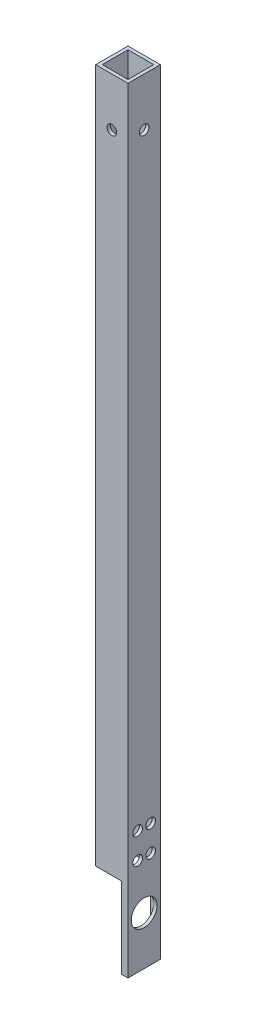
ISO-10303-21;
HEADER;
FILE_DESCRIPTION(('STEP AP214'),'2;1');
FILE_NAME('part.step','',(''),(''),'','','');
FILE_SCHEMA(('AUTOMOTIVE_DESIGN { 1 0 10303 214 1 1 1 1 }'));
ENDSEC;
DATA;
#1=APPLICATION_CONTEXT('core data for automotive mechanical design processes');
#2=APPLICATION_PROTOCOL_DEFINITION('international standard','automotive_design',2000,#1);
#3=PRODUCT_CONTEXT('',#1,'mechanical');
#4=PRODUCT('Part','Part','',(#3));
#5=PRODUCT_RELATED_PRODUCT_CATEGORY('part','',(#4));
#6=PRODUCT_DEFINITION_FORMATION('','',#4);
#7=PRODUCT_DEFINITION_CONTEXT('part definition',#1,'design');
#8=PRODUCT_DEFINITION('design','',#6,#7);
#9=PRODUCT_DEFINITION_SHAPE('','',#8);
#10=(LENGTH_UNIT() NAMED_UNIT(*) SI_UNIT(.MILLI.,.METRE.));
#11=(NAMED_UNIT(*) PLANE_ANGLE_UNIT() SI_UNIT($,.RADIAN.));
#12=(NAMED_UNIT(*) SI_UNIT($,.STERADIAN.) SOLID_ANGLE_UNIT());
#13=UNCERTAINTY_MEASURE_WITH_UNIT(LENGTH_MEASURE(1.E-05),#10,'distance_accuracy_value','');
#14=(GEOMETRIC_REPRESENTATION_CONTEXT(3) GLOBAL_UNCERTAINTY_ASSIGNED_CONTEXT((#13)) GLOBAL_UNIT_ASSIGNED_CONTEXT((#10,
#11,#12)) REPRESENTATION_CONTEXT('',''));
#15=CARTESIAN_POINT('',(0.,0.,0.));
#16=DIRECTION('',(0.,0.,1.));
#17=DIRECTION('',(1.,0.,0.));
#18=AXIS2_PLACEMENT_3D('',#15,#16,#17);
#19=CARTESIAN_POINT('',(0.,0.,0.));
#20=DIRECTION('',(0.,-1.,0.));
#21=DIRECTION('',(0.,0.,-1.));
#22=AXIS2_PLACEMENT_3D('',#19,#20,#21);
#23=PLANE('',#22);
#24=DIRECTION('',(1.,0.,0.));
#25=VECTOR('',#24,1.);
#26=CARTESIAN_POINT('',(-5.,0.,5.));
#27=LINE('',#26,#25);
#28=CARTESIAN_POINT('',(3.,0.,5.));
#29=VERTEX_POINT('',#28);
#30=CARTESIAN_POINT('',(5.,0.,5.));
#31=VERTEX_POINT('',#30);
#32=EDGE_CURVE('E155',#29,#31,#27,.T.);
#33=ORIENTED_EDGE('',*,*,#32,.F.);
#34=DIRECTION('',(0.,0.,1.));
#35=VECTOR('',#34,1.);
#36=CARTESIAN_POINT('',(3.,0.,-5.));
#37=LINE('',#36,#35);
#38=CARTESIAN_POINT('',(3.,0.,4.));
#39=VERTEX_POINT('',#38);
#40=EDGE_CURVE('E137',#39,#29,#37,.T.);
#41=ORIENTED_EDGE('',*,*,#40,.F.);
#42=DIRECTION('',(1.,0.,0.));
#43=VECTOR('',#42,1.);
#44=CARTESIAN_POINT('',(-4.,0.,4.));
#45=LINE('',#44,#43);
#46=CARTESIAN_POINT('',(4.,0.,4.));
#47=VERTEX_POINT('',#46);
#48=EDGE_CURVE('E210',#39,#47,#45,.T.);
#49=ORIENTED_EDGE('',*,*,#48,.T.);
#50=DIRECTION('',(0.,0.,-1.));
#51=VECTOR('',#50,1.);
#52=CARTESIAN_POINT('',(4.,0.,4.));
#53=LINE('',#52,#51);
#54=CARTESIAN_POINT('',(4.,0.,-4.));
#55=VERTEX_POINT('',#54);
#56=EDGE_CURVE('E277',#47,#55,#53,.T.);
#57=ORIENTED_EDGE('',*,*,#56,.T.);
#58=DIRECTION('',(-1.,0.,0.));
#59=VECTOR('',#58,1.);
#60=CARTESIAN_POINT('',(-4.,0.,-4.));
#61=LINE('',#60,#59);
#62=CARTESIAN_POINT('',(3.,0.,-4.));
#63=VERTEX_POINT('',#62);
#64=EDGE_CURVE('E148',#55,#63,#61,.T.);
#65=ORIENTED_EDGE('',*,*,#64,.T.);
#66=CARTESIAN_POINT('',(3.,0.,-5.));
#67=VERTEX_POINT('',#66);
#68=EDGE_CURVE('E129',#67,#63,#37,.T.);
#69=ORIENTED_EDGE('',*,*,#68,.F.);
#70=DIRECTION('',(-1.,0.,0.));
#71=VECTOR('',#70,1.);
#72=CARTESIAN_POINT('',(-5.,0.,-5.));
#73=LINE('',#72,#71);
#74=CARTESIAN_POINT('',(5.,0.,-5.));
#75=VERTEX_POINT('',#74);
#76=EDGE_CURVE('E144',#75,#67,#73,.T.);
#77=ORIENTED_EDGE('',*,*,#76,.F.);
#78=DIRECTION('',(0.,0.,-1.));
#79=VECTOR('',#78,1.);
#80=CARTESIAN_POINT('',(5.,0.,5.));
#81=LINE('',#80,#79);
#82=EDGE_CURVE('E156',#31,#75,#81,.T.);
#83=ORIENTED_EDGE('',*,*,#82,.F.);
#84=EDGE_LOOP('',(#33,#41,#49,#57,#65,#69,#77,#83));
#85=FACE_BOUND('',#84,.T.);
#86=ADVANCED_FACE('F33',(#85),#23,.T.);
#87=CARTESIAN_POINT('',(4.,240.,4.));
#88=DIRECTION('',(-1.,0.,0.));
#89=DIRECTION('',(0.,0.,1.));
#90=AXIS2_PLACEMENT_3D('',#87,#88,#89);
#91=PLANE('',#90);
#92=CARTESIAN_POINT('',(4.,15.,0.));
#93=DIRECTION('',(-1.,0.,0.));
#94=DIRECTION('',(0.,0.,1.));
#95=AXIS2_PLACEMENT_3D('',#92,#93,#94);
#96=CIRCLE('',#95,4.);
#97=CARTESIAN_POINT('',(4.,15.,-4.));
#98=VERTEX_POINT('',#97);
#99=CARTESIAN_POINT('',(4.,15.,4.));
#100=VERTEX_POINT('',#99);
#101=EDGE_CURVE('E54',#98,#100,#96,.F.);
#102=ORIENTED_EDGE('',*,*,#101,.T.);
#103=DIRECTION('',(0.,-1.,0.));
#104=VECTOR('',#103,1.);
#105=CARTESIAN_POINT('',(4.,240.,4.));
#106=LINE('',#105,#104);
#107=CARTESIAN_POINT('',(4.,240.,4.));
#108=VERTEX_POINT('',#107);
#109=EDGE_CURVE('E291',#108,#100,#106,.T.);
#110=ORIENTED_EDGE('',*,*,#109,.F.);
#111=DIRECTION('',(0.,0.,-1.));
#112=VECTOR('',#111,1.);
#113=CARTESIAN_POINT('',(4.,240.,4.));
#114=LINE('',#113,#112);
#115=CARTESIAN_POINT('',(4.,240.,-4.));
#116=VERTEX_POINT('',#115);
#117=EDGE_CURVE('E278',#108,#116,#114,.T.);
#118=ORIENTED_EDGE('',*,*,#117,.T.);
#119=DIRECTION('',(0.,-1.,0.));
#120=VECTOR('',#119,1.);
#121=CARTESIAN_POINT('',(4.,240.,-4.));
#122=LINE('',#121,#120);
#123=EDGE_CURVE('E160',#116,#98,#122,.T.);
#124=ORIENTED_EDGE('',*,*,#123,.T.);
#125=EDGE_LOOP('',(#102,#110,#118,#124));
#126=FACE_BOUND('',#125,.T.);
#127=CARTESIAN_POINT('',(4.,30.,2.));
#128=DIRECTION('',(-1.,0.,0.));
#129=DIRECTION('',(0.,0.,1.));
#130=AXIS2_PLACEMENT_3D('',#127,#128,#129);
#131=CIRCLE('',#130,1.5);
#132=CARTESIAN_POINT('',(4.,30.,3.5));
#133=VERTEX_POINT('',#132);
#134=EDGE_CURVE('E201',#133,#133,#131,.T.);
#135=ORIENTED_EDGE('',*,*,#134,.F.);
#136=EDGE_LOOP('',(#135));
#137=FACE_BOUND('',#136,.T.);
#138=CARTESIAN_POINT('',(4.,38.,-2.));
#139=DIRECTION('',(-1.,0.,0.));
#140=DIRECTION('',(0.,0.,1.));
#141=AXIS2_PLACEMENT_3D('',#138,#139,#140);
#142=CIRCLE('',#141,1.5);
#143=CARTESIAN_POINT('',(4.,38.,-0.499999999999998));
#144=VERTEX_POINT('',#143);
#145=EDGE_CURVE('E198',#144,#144,#142,.T.);
#146=ORIENTED_EDGE('',*,*,#145,.F.);
#147=EDGE_LOOP('',(#146));
#148=FACE_BOUND('',#147,.T.);
#149=CARTESIAN_POINT('',(4.,38.,2.));
#150=DIRECTION('',(-1.,0.,0.));
#151=DIRECTION('',(0.,0.,1.));
#152=AXIS2_PLACEMENT_3D('',#149,#150,#151);
#153=CIRCLE('',#152,1.5);
#154=CARTESIAN_POINT('',(4.,38.,3.5));
#155=VERTEX_POINT('',#154);
#156=EDGE_CURVE('E193',#155,#155,#153,.T.);
#157=ORIENTED_EDGE('',*,*,#156,.F.);
#158=EDGE_LOOP('',(#157));
#159=FACE_BOUND('',#158,.T.);
#160=CARTESIAN_POINT('',(4.,30.,-2.));
#161=DIRECTION('',(-1.,0.,0.));
#162=DIRECTION('',(0.,0.,1.));
#163=AXIS2_PLACEMENT_3D('',#160,#161,#162);
#164=CIRCLE('',#163,1.5);
#165=CARTESIAN_POINT('',(4.,30.,-0.499999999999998));
#166=VERTEX_POINT('',#165);
#167=EDGE_CURVE('E188',#166,#166,#164,.T.);
#168=ORIENTED_EDGE('',*,*,#167,.F.);
#169=EDGE_LOOP('',(#168));
#170=FACE_BOUND('',#169,.T.);
#171=CARTESIAN_POINT('',(4.,225.,0.));
#172=DIRECTION('',(-1.,0.,0.));
#173=DIRECTION('',(0.,0.,1.));
#174=AXIS2_PLACEMENT_3D('',#171,#172,#173);
#175=CIRCLE('',#174,1.5);
#176=CARTESIAN_POINT('',(4.,225.,1.5));
#177=VERTEX_POINT('',#176);
#178=EDGE_CURVE('E183',#177,#177,#175,.T.);
#179=ORIENTED_EDGE('',*,*,#178,.F.);
#180=EDGE_LOOP('',(#179));
#181=FACE_BOUND('',#180,.T.);
#182=ADVANCED_FACE('F326',(#126,#137,#148,#159,#170,#181),#91,.T.);
#183=CARTESIAN_POINT('',(0.,240.,0.));
#184=DIRECTION('',(0.,-1.,0.));
#185=DIRECTION('',(0.,0.,-1.));
#186=AXIS2_PLACEMENT_3D('',#183,#184,#185);
#187=PLANE('',#186);
#188=DIRECTION('',(0.,0.,-1.));
#189=VECTOR('',#188,1.);
#190=CARTESIAN_POINT('',(5.,240.,5.));
#191=LINE('',#190,#189);
#192=CARTESIAN_POINT('',(5.,240.,5.));
#193=VERTEX_POINT('',#192);
#194=CARTESIAN_POINT('',(5.,240.,-5.));
#195=VERTEX_POINT('',#194);
#196=EDGE_CURVE('E158',#193,#195,#191,.T.);
#197=ORIENTED_EDGE('',*,*,#196,.T.);
#198=DIRECTION('',(-1.,0.,0.));
#199=VECTOR('',#198,1.);
#200=CARTESIAN_POINT('',(-5.,240.,-5.));
#201=LINE('',#200,#199);
#202=CARTESIAN_POINT('',(-5.,240.,-5.));
#203=VERTEX_POINT('',#202);
#204=EDGE_CURVE('E304',#195,#203,#201,.T.);
#205=ORIENTED_EDGE('',*,*,#204,.T.);
#206=DIRECTION('',(0.,0.,1.));
#207=VECTOR('',#206,1.);
#208=CARTESIAN_POINT('',(-5.,240.,5.));
#209=LINE('',#208,#207);
#210=CARTESIAN_POINT('',(-5.,240.,5.));
#211=VERTEX_POINT('',#210);
#212=EDGE_CURVE('E306',#203,#211,#209,.T.);
#213=ORIENTED_EDGE('',*,*,#212,.T.);
#214=DIRECTION('',(1.,0.,0.));
#215=VECTOR('',#214,1.);
#216=CARTESIAN_POINT('',(-5.,240.,5.));
#217=LINE('',#216,#215);
#218=EDGE_CURVE('E168',#211,#193,#217,.T.);
#219=ORIENTED_EDGE('',*,*,#218,.T.);
#220=EDGE_LOOP('',(#197,#205,#213,#219));
#221=FACE_BOUND('',#220,.T.);
#222=ORIENTED_EDGE('',*,*,#117,.F.);
#223=DIRECTION('',(1.,0.,0.));
#224=VECTOR('',#223,1.);
#225=CARTESIAN_POINT('',(-4.,240.,4.));
#226=LINE('',#225,#224);
#227=CARTESIAN_POINT('',(-4.,240.,4.));
#228=VERTEX_POINT('',#227);
#229=EDGE_CURVE('E285',#228,#108,#226,.T.);
#230=ORIENTED_EDGE('',*,*,#229,.F.);
#231=DIRECTION('',(0.,0.,1.));
#232=VECTOR('',#231,1.);
#233=CARTESIAN_POINT('',(-4.,240.,4.));
#234=LINE('',#233,#232);
#235=CARTESIAN_POINT('',(-4.,240.,-4.));
#236=VERTEX_POINT('',#235);
#237=EDGE_CURVE('E282',#236,#228,#234,.T.);
#238=ORIENTED_EDGE('',*,*,#237,.F.);
#239=DIRECTION('',(-1.,0.,0.));
#240=VECTOR('',#239,1.);
#241=CARTESIAN_POINT('',(-4.,240.,-4.));
#242=LINE('',#241,#240);
#243=EDGE_CURVE('E280',#116,#236,#242,.T.);
#244=ORIENTED_EDGE('',*,*,#243,.F.);
#245=EDGE_LOOP('',(#222,#230,#238,#244));
#246=FACE_BOUND('',#245,.T.);
#247=ADVANCED_FACE('F310',(#221,#246),#187,.F.);
#248=CARTESIAN_POINT('',(5.,240.,5.));
#249=DIRECTION('',(-1.,0.,0.));
#250=DIRECTION('',(0.,0.,1.));
#251=AXIS2_PLACEMENT_3D('',#248,#249,#250);
#252=PLANE('',#251);
#253=CARTESIAN_POINT('',(5.,15.,0.));
#254=DIRECTION('',(1.,0.,0.));
#255=DIRECTION('',(0.,0.,-1.));
#256=AXIS2_PLACEMENT_3D('',#253,#254,#255);
#257=CIRCLE('',#256,4.);
#258=CARTESIAN_POINT('',(5.,15.,-4.));
#259=VERTEX_POINT('',#258);
#260=EDGE_CURVE('E228',#259,#259,#257,.T.);
#261=ORIENTED_EDGE('',*,*,#260,.F.);
#262=EDGE_LOOP('',(#261));
#263=FACE_BOUND('',#262,.T.);
#264=CARTESIAN_POINT('',(5.,30.,2.));
#265=DIRECTION('',(1.,0.,0.));
#266=DIRECTION('',(0.,0.,-1.));
#267=AXIS2_PLACEMENT_3D('',#264,#265,#266);
#268=CIRCLE('',#267,1.5);
#269=CARTESIAN_POINT('',(5.,30.,0.499999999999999));
#270=VERTEX_POINT('',#269);
#271=EDGE_CURVE('E234',#270,#270,#268,.T.);
#272=ORIENTED_EDGE('',*,*,#271,.F.);
#273=EDGE_LOOP('',(#272));
#274=FACE_BOUND('',#273,.T.);
#275=CARTESIAN_POINT('',(5.,38.,-2.));
#276=DIRECTION('',(1.,0.,0.));
#277=DIRECTION('',(0.,0.,-1.));
#278=AXIS2_PLACEMENT_3D('',#275,#276,#277);
#279=CIRCLE('',#278,1.5);
#280=CARTESIAN_POINT('',(5.,38.,-3.5));
#281=VERTEX_POINT('',#280);
#282=EDGE_CURVE('E240',#281,#281,#279,.T.);
#283=ORIENTED_EDGE('',*,*,#282,.F.);
#284=EDGE_LOOP('',(#283));
#285=FACE_BOUND('',#284,.T.);
#286=CARTESIAN_POINT('',(5.,38.,2.));
#287=DIRECTION('',(1.,0.,0.));
#288=DIRECTION('',(0.,0.,-1.));
#289=AXIS2_PLACEMENT_3D('',#286,#287,#288);
#290=CIRCLE('',#289,1.5);
#291=CARTESIAN_POINT('',(5.,38.,0.499999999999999));
#292=VERTEX_POINT('',#291);
#293=EDGE_CURVE('E233',#292,#292,#290,.T.);
#294=ORIENTED_EDGE('',*,*,#293,.F.);
#295=EDGE_LOOP('',(#294));
#296=FACE_BOUND('',#295,.T.);
#297=CARTESIAN_POINT('',(5.,30.,-2.));
#298=DIRECTION('',(1.,0.,0.));
#299=DIRECTION('',(0.,0.,-1.));
#300=AXIS2_PLACEMENT_3D('',#297,#298,#299);
#301=CIRCLE('',#300,1.5);
#302=CARTESIAN_POINT('',(5.,30.,-3.5));
#303=VERTEX_POINT('',#302);
#304=EDGE_CURVE('E256',#303,#303,#301,.T.);
#305=ORIENTED_EDGE('',*,*,#304,.F.);
#306=EDGE_LOOP('',(#305));
#307=FACE_BOUND('',#306,.T.);
#308=CARTESIAN_POINT('',(5.,225.,0.));
#309=DIRECTION('',(1.,0.,0.));
#310=DIRECTION('',(0.,0.,-1.));
#311=AXIS2_PLACEMENT_3D('',#308,#309,#310);
#312=CIRCLE('',#311,1.5);
#313=CARTESIAN_POINT('',(5.,225.,-1.5));
#314=VERTEX_POINT('',#313);
#315=EDGE_CURVE('E263',#314,#314,#312,.T.);
#316=ORIENTED_EDGE('',*,*,#315,.F.);
#317=EDGE_LOOP('',(#316));
#318=FACE_BOUND('',#317,.T.);
#319=ORIENTED_EDGE('',*,*,#82,.T.);
#320=DIRECTION('',(0.,-1.,0.));
#321=VECTOR('',#320,1.);
#322=CARTESIAN_POINT('',(5.,240.,-5.));
#323=LINE('',#322,#321);
#324=EDGE_CURVE('E153',#195,#75,#323,.T.);
#325=ORIENTED_EDGE('',*,*,#324,.F.);
#326=ORIENTED_EDGE('',*,*,#196,.F.);
#327=DIRECTION('',(0.,-1.,0.));
#328=VECTOR('',#327,1.);
#329=CARTESIAN_POINT('',(5.,240.,5.));
#330=LINE('',#329,#328);
#331=EDGE_CURVE('E164',#193,#31,#330,.T.);
#332=ORIENTED_EDGE('',*,*,#331,.T.);
#333=EDGE_LOOP('',(#319,#325,#326,#332));
#334=FACE_BOUND('',#333,.T.);
#335=ADVANCED_FACE('F35',(#263,#274,#285,#296,#307,#318,#334),#252,.F.);
#336=CARTESIAN_POINT('',(-5.,240.,-5.));
#337=DIRECTION('',(0.,0.,1.));
#338=DIRECTION('',(1.,0.,0.));
#339=AXIS2_PLACEMENT_3D('',#336,#337,#338);
#340=PLANE('',#339);
#341=CARTESIAN_POINT('',(0.,225.,-5.));
#342=DIRECTION('',(0.,0.,1.));
#343=DIRECTION('',(1.,0.,0.));
#344=AXIS2_PLACEMENT_3D('',#341,#342,#343);
#345=CIRCLE('',#344,1.5);
#346=CARTESIAN_POINT('',(1.5,225.,-5.));
#347=VERTEX_POINT('',#346);
#348=EDGE_CURVE('E179',#347,#347,#345,.F.);
#349=ORIENTED_EDGE('',*,*,#348,.F.);
#350=EDGE_LOOP('',(#349));
#351=FACE_BOUND('',#350,.T.);
#352=DIRECTION('',(0.,-1.,0.));
#353=VECTOR('',#352,1.);
#354=CARTESIAN_POINT('',(3.,25.,-5.));
#355=LINE('',#354,#353);
#356=CARTESIAN_POINT('',(3.,25.,-5.));
#357=VERTEX_POINT('',#356);
#358=EDGE_CURVE('E126',#357,#67,#355,.T.);
#359=ORIENTED_EDGE('',*,*,#358,.F.);
#360=DIRECTION('',(-1.,0.,0.));
#361=VECTOR('',#360,1.);
#362=CARTESIAN_POINT('',(3.,25.,-5.));
#363=LINE('',#362,#361);
#364=CARTESIAN_POINT('',(-5.,25.,-5.));
#365=VERTEX_POINT('',#364);
#366=EDGE_CURVE('E219',#357,#365,#363,.T.);
#367=ORIENTED_EDGE('',*,*,#366,.T.);
#368=DIRECTION('',(0.,-1.,0.));
#369=VECTOR('',#368,1.);
#370=CARTESIAN_POINT('',(-5.,240.,-5.));
#371=LINE('',#370,#369);
#372=EDGE_CURVE('E171',#203,#365,#371,.T.);
#373=ORIENTED_EDGE('',*,*,#372,.F.);
#374=ORIENTED_EDGE('',*,*,#204,.F.);
#375=ORIENTED_EDGE('',*,*,#324,.T.);
#376=ORIENTED_EDGE('',*,*,#76,.T.);
#377=EDGE_LOOP('',(#359,#367,#373,#374,#375,#376));
#378=FACE_BOUND('',#377,.T.);
#379=ADVANCED_FACE('F151',(#351,#378),#340,.F.);
#380=CARTESIAN_POINT('',(-5.,240.,5.));
#381=DIRECTION('',(1.,0.,0.));
#382=DIRECTION('',(0.,0.,-1.));
#383=AXIS2_PLACEMENT_3D('',#380,#381,#382);
#384=PLANE('',#383);
#385=CARTESIAN_POINT('',(-5.,30.,2.));
#386=DIRECTION('',(1.,0.,0.));
#387=DIRECTION('',(0.,0.,-1.));
#388=AXIS2_PLACEMENT_3D('',#385,#386,#387);
#389=CIRCLE('',#388,1.5);
#390=CARTESIAN_POINT('',(-5.,30.,0.5));
#391=VERTEX_POINT('',#390);
#392=EDGE_CURVE('E194',#391,#391,#389,.F.);
#393=ORIENTED_EDGE('',*,*,#392,.F.);
#394=EDGE_LOOP('',(#393));
#395=FACE_BOUND('',#394,.T.);
#396=CARTESIAN_POINT('',(-5.,38.,-2.));
#397=DIRECTION('',(1.,0.,0.));
#398=DIRECTION('',(0.,0.,-1.));
#399=AXIS2_PLACEMENT_3D('',#396,#397,#398);
#400=CIRCLE('',#399,1.5);
#401=CARTESIAN_POINT('',(-5.,38.,-3.5));
#402=VERTEX_POINT('',#401);
#403=EDGE_CURVE('E237',#402,#402,#400,.F.);
#404=ORIENTED_EDGE('',*,*,#403,.F.);
#405=EDGE_LOOP('',(#404));
#406=FACE_BOUND('',#405,.T.);
#407=CARTESIAN_POINT('',(-5.,38.,2.));
#408=DIRECTION('',(1.,0.,0.));
#409=DIRECTION('',(0.,0.,-1.));
#410=AXIS2_PLACEMENT_3D('',#407,#408,#409);
#411=CIRCLE('',#410,1.5);
#412=CARTESIAN_POINT('',(-5.,38.,0.5));
#413=VERTEX_POINT('',#412);
#414=EDGE_CURVE('E243',#413,#413,#411,.F.);
#415=ORIENTED_EDGE('',*,*,#414,.F.);
#416=EDGE_LOOP('',(#415));
#417=FACE_BOUND('',#416,.T.);
#418=CARTESIAN_POINT('',(-5.,30.,-2.));
#419=DIRECTION('',(1.,0.,0.));
#420=DIRECTION('',(0.,0.,-1.));
#421=AXIS2_PLACEMENT_3D('',#418,#419,#420);
#422=CIRCLE('',#421,1.5);
#423=CARTESIAN_POINT('',(-5.,30.,-3.5));
#424=VERTEX_POINT('',#423);
#425=EDGE_CURVE('E189',#424,#424,#422,.F.);
#426=ORIENTED_EDGE('',*,*,#425,.F.);
#427=EDGE_LOOP('',(#426));
#428=FACE_BOUND('',#427,.T.);
#429=CARTESIAN_POINT('',(-5.,225.,0.));
#430=DIRECTION('',(1.,0.,0.));
#431=DIRECTION('',(0.,0.,-1.));
#432=AXIS2_PLACEMENT_3D('',#429,#430,#431);
#433=CIRCLE('',#432,1.5);
#434=CARTESIAN_POINT('',(-5.,225.,-1.5));
#435=VERTEX_POINT('',#434);
#436=EDGE_CURVE('E184',#435,#435,#433,.F.);
#437=ORIENTED_EDGE('',*,*,#436,.F.);
#438=EDGE_LOOP('',(#437));
#439=FACE_BOUND('',#438,.T.);
#440=ORIENTED_EDGE('',*,*,#372,.T.);
#441=DIRECTION('',(0.,0.,-1.));
#442=VECTOR('',#441,1.);
#443=CARTESIAN_POINT('',(-5.,25.,-5.));
#444=LINE('',#443,#442);
#445=CARTESIAN_POINT('',(-5.,25.,5.));
#446=VERTEX_POINT('',#445);
#447=EDGE_CURVE('E138',#446,#365,#444,.T.);
#448=ORIENTED_EDGE('',*,*,#447,.F.);
#449=DIRECTION('',(0.,-1.,0.));
#450=VECTOR('',#449,1.);
#451=CARTESIAN_POINT('',(-5.,240.,5.));
#452=LINE('',#451,#450);
#453=EDGE_CURVE('E167',#211,#446,#452,.T.);
#454=ORIENTED_EDGE('',*,*,#453,.F.);
#455=ORIENTED_EDGE('',*,*,#212,.F.);
#456=EDGE_LOOP('',(#440,#448,#454,#455));
#457=FACE_BOUND('',#456,.T.);
#458=ADVANCED_FACE('F324',(#395,#406,#417,#428,#439,#457),#384,.F.);
#459=CARTESIAN_POINT('',(-5.,240.,5.));
#460=DIRECTION('',(0.,0.,-1.));
#461=DIRECTION('',(-1.,0.,0.));
#462=AXIS2_PLACEMENT_3D('',#459,#460,#461);
#463=PLANE('',#462);
#464=CARTESIAN_POINT('',(0.,225.,5.));
#465=DIRECTION('',(0.,0.,1.));
#466=DIRECTION('',(1.,0.,0.));
#467=AXIS2_PLACEMENT_3D('',#464,#465,#466);
#468=CIRCLE('',#467,1.5);
#469=CARTESIAN_POINT('',(1.5,225.,5.));
#470=VERTEX_POINT('',#469);
#471=EDGE_CURVE('E270',#470,#470,#468,.T.);
#472=ORIENTED_EDGE('',*,*,#471,.F.);
#473=EDGE_LOOP('',(#472));
#474=FACE_BOUND('',#473,.T.);
#475=ORIENTED_EDGE('',*,*,#453,.T.);
#476=DIRECTION('',(-1.,0.,0.));
#477=VECTOR('',#476,1.);
#478=CARTESIAN_POINT('',(3.,25.,5.));
#479=LINE('',#478,#477);
#480=CARTESIAN_POINT('',(3.,25.,5.));
#481=VERTEX_POINT('',#480);
#482=EDGE_CURVE('E217',#481,#446,#479,.T.);
#483=ORIENTED_EDGE('',*,*,#482,.F.);
#484=DIRECTION('',(0.,1.,0.));
#485=VECTOR('',#484,1.);
#486=CARTESIAN_POINT('',(3.,25.,5.));
#487=LINE('',#486,#485);
#488=EDGE_CURVE('E149',#29,#481,#487,.T.);
#489=ORIENTED_EDGE('',*,*,#488,.F.);
#490=ORIENTED_EDGE('',*,*,#32,.T.);
#491=ORIENTED_EDGE('',*,*,#331,.F.);
#492=ORIENTED_EDGE('',*,*,#218,.F.);
#493=EDGE_LOOP('',(#475,#483,#489,#490,#491,#492));
#494=FACE_BOUND('',#493,.T.);
#495=ADVANCED_FACE('F316',(#474,#494),#463,.F.);
#496=EDGE_CURVE('E231',#100,#98,#96,.F.);
#497=ORIENTED_EDGE('',*,*,#496,.T.);
#498=EDGE_CURVE('E299',#98,#55,#122,.T.);
#499=ORIENTED_EDGE('',*,*,#498,.T.);
#500=ORIENTED_EDGE('',*,*,#56,.F.);
#501=EDGE_CURVE('E287',#100,#47,#106,.T.);
#502=ORIENTED_EDGE('',*,*,#501,.F.);
#503=EDGE_LOOP('',(#497,#499,#500,#502));
#504=FACE_BOUND('',#503,.T.);
#505=ADVANCED_FACE('F337',(#504),#91,.T.);
#506=CARTESIAN_POINT('',(-4.,240.,-4.));
#507=DIRECTION('',(0.,0.,1.));
#508=DIRECTION('',(1.,0.,0.));
#509=AXIS2_PLACEMENT_3D('',#506,#507,#508);
#510=PLANE('',#509);
#511=DIRECTION('',(-1.,0.,0.));
#512=VECTOR('',#511,1.);
#513=CARTESIAN_POINT('',(-4.,25.,-4.));
#514=LINE('',#513,#512);
#515=CARTESIAN_POINT('',(3.,25.,-4.));
#516=VERTEX_POINT('',#515);
#517=CARTESIAN_POINT('',(-4.,25.,-4.));
#518=VERTEX_POINT('',#517);
#519=EDGE_CURVE('E226',#516,#518,#514,.T.);
#520=ORIENTED_EDGE('',*,*,#519,.F.);
#521=DIRECTION('',(0.,-1.,0.));
#522=VECTOR('',#521,1.);
#523=CARTESIAN_POINT('',(3.,240.,-4.));
#524=LINE('',#523,#522);
#525=EDGE_CURVE('E221',#516,#63,#524,.T.);
#526=ORIENTED_EDGE('',*,*,#525,.T.);
#527=ORIENTED_EDGE('',*,*,#64,.F.);
#528=ORIENTED_EDGE('',*,*,#498,.F.);
#529=ORIENTED_EDGE('',*,*,#123,.F.);
#530=ORIENTED_EDGE('',*,*,#243,.T.);
#531=DIRECTION('',(0.,-1.,0.));
#532=VECTOR('',#531,1.);
#533=CARTESIAN_POINT('',(-4.,240.,-4.));
#534=LINE('',#533,#532);
#535=EDGE_CURVE('E296',#236,#518,#534,.T.);
#536=ORIENTED_EDGE('',*,*,#535,.T.);
#537=EDGE_LOOP('',(#520,#526,#527,#528,#529,#530,#536));
#538=FACE_BOUND('',#537,.T.);
#539=CARTESIAN_POINT('',(0.,225.,-4.));
#540=DIRECTION('',(0.,0.,1.));
#541=DIRECTION('',(1.,0.,0.));
#542=AXIS2_PLACEMENT_3D('',#539,#540,#541);
#543=CIRCLE('',#542,1.5);
#544=CARTESIAN_POINT('',(1.5,225.,-4.));
#545=VERTEX_POINT('',#544);
#546=EDGE_CURVE('E178',#545,#545,#543,.T.);
#547=ORIENTED_EDGE('',*,*,#546,.F.);
#548=EDGE_LOOP('',(#547));
#549=FACE_BOUND('',#548,.T.);
#550=ADVANCED_FACE('F369',(#538,#549),#510,.T.);
#551=CARTESIAN_POINT('',(-4.,240.,4.));
#552=DIRECTION('',(1.,0.,0.));
#553=DIRECTION('',(0.,0.,-1.));
#554=AXIS2_PLACEMENT_3D('',#551,#552,#553);
#555=PLANE('',#554);
#556=DIRECTION('',(0.,0.,1.));
#557=VECTOR('',#556,1.);
#558=CARTESIAN_POINT('',(-4.,25.,3.99999999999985));
#559=LINE('',#558,#557);
#560=CARTESIAN_POINT('',(-4.,25.,4.));
#561=VERTEX_POINT('',#560);
#562=EDGE_CURVE('E224',#518,#561,#559,.T.);
#563=ORIENTED_EDGE('',*,*,#562,.F.);
#564=ORIENTED_EDGE('',*,*,#535,.F.);
#565=ORIENTED_EDGE('',*,*,#237,.T.);
#566=DIRECTION('',(0.,-1.,0.));
#567=VECTOR('',#566,1.);
#568=CARTESIAN_POINT('',(-4.,240.,4.));
#569=LINE('',#568,#567);
#570=EDGE_CURVE('E294',#228,#561,#569,.T.);
#571=ORIENTED_EDGE('',*,*,#570,.T.);
#572=EDGE_LOOP('',(#563,#564,#565,#571));
#573=FACE_BOUND('',#572,.T.);
#574=CARTESIAN_POINT('',(-4.,30.,2.));
#575=DIRECTION('',(1.,0.,0.));
#576=DIRECTION('',(0.,0.,-1.));
#577=AXIS2_PLACEMENT_3D('',#574,#575,#576);
#578=CIRCLE('',#577,1.5);
#579=CARTESIAN_POINT('',(-4.,30.,0.5));
#580=VERTEX_POINT('',#579);
#581=EDGE_CURVE('E199',#580,#580,#578,.T.);
#582=ORIENTED_EDGE('',*,*,#581,.F.);
#583=EDGE_LOOP('',(#582));
#584=FACE_BOUND('',#583,.T.);
#585=CARTESIAN_POINT('',(-4.,38.,-2.));
#586=DIRECTION('',(1.,0.,0.));
#587=DIRECTION('',(0.,0.,-1.));
#588=AXIS2_PLACEMENT_3D('',#585,#586,#587);
#589=CIRCLE('',#588,1.5);
#590=CARTESIAN_POINT('',(-4.,38.,-3.5));
#591=VERTEX_POINT('',#590);
#592=EDGE_CURVE('E195',#591,#591,#589,.T.);
#593=ORIENTED_EDGE('',*,*,#592,.F.);
#594=EDGE_LOOP('',(#593));
#595=FACE_BOUND('',#594,.T.);
#596=CARTESIAN_POINT('',(-4.,38.,2.));
#597=DIRECTION('',(1.,0.,0.));
#598=DIRECTION('',(0.,0.,-1.));
#599=AXIS2_PLACEMENT_3D('',#596,#597,#598);
#600=CIRCLE('',#599,1.5);
#601=CARTESIAN_POINT('',(-4.,38.,0.5));
#602=VERTEX_POINT('',#601);
#603=EDGE_CURVE('E190',#602,#602,#600,.T.);
#604=ORIENTED_EDGE('',*,*,#603,.F.);
#605=EDGE_LOOP('',(#604));
#606=FACE_BOUND('',#605,.T.);
#607=CARTESIAN_POINT('',(-4.,30.,-2.));
#608=DIRECTION('',(1.,0.,0.));
#609=DIRECTION('',(0.,0.,-1.));
#610=AXIS2_PLACEMENT_3D('',#607,#608,#609);
#611=CIRCLE('',#610,1.5);
#612=CARTESIAN_POINT('',(-4.,30.,-3.5));
#613=VERTEX_POINT('',#612);
#614=EDGE_CURVE('E185',#613,#613,#611,.T.);
#615=ORIENTED_EDGE('',*,*,#614,.F.);
#616=EDGE_LOOP('',(#615));
#617=FACE_BOUND('',#616,.T.);
#618=CARTESIAN_POINT('',(-4.,225.,0.));
#619=DIRECTION('',(1.,0.,0.));
#620=DIRECTION('',(0.,0.,-1.));
#621=AXIS2_PLACEMENT_3D('',#618,#619,#620);
#622=CIRCLE('',#621,1.5);
#623=CARTESIAN_POINT('',(-4.,225.,-1.5));
#624=VERTEX_POINT('',#623);
#625=EDGE_CURVE('E180',#624,#624,#622,.T.);
#626=ORIENTED_EDGE('',*,*,#625,.F.);
#627=EDGE_LOOP('',(#626));
#628=FACE_BOUND('',#627,.T.);
#629=ADVANCED_FACE('F365',(#573,#584,#595,#606,#617,#628),#555,.T.);
#630=CARTESIAN_POINT('',(-4.,240.,4.));
#631=DIRECTION('',(0.,0.,-1.));
#632=DIRECTION('',(-1.,0.,0.));
#633=AXIS2_PLACEMENT_3D('',#630,#631,#632);
#634=PLANE('',#633);
#635=DIRECTION('',(1.,0.,0.));
#636=VECTOR('',#635,1.);
#637=CARTESIAN_POINT('',(-4.,25.,4.));
#638=LINE('',#637,#636);
#639=CARTESIAN_POINT('',(3.,25.,4.));
#640=VERTEX_POINT('',#639);
#641=EDGE_CURVE('E11',#561,#640,#638,.T.);
#642=ORIENTED_EDGE('',*,*,#641,.F.);
#643=ORIENTED_EDGE('',*,*,#570,.F.);
#644=ORIENTED_EDGE('',*,*,#229,.T.);
#645=ORIENTED_EDGE('',*,*,#109,.T.);
#646=ORIENTED_EDGE('',*,*,#501,.T.);
#647=ORIENTED_EDGE('',*,*,#48,.F.);
#648=DIRECTION('',(0.,1.,0.));
#649=VECTOR('',#648,1.);
#650=CARTESIAN_POINT('',(3.,240.,4.));
#651=LINE('',#650,#649);
#652=EDGE_CURVE('E41',#39,#640,#651,.T.);
#653=ORIENTED_EDGE('',*,*,#652,.T.);
#654=EDGE_LOOP('',(#642,#643,#644,#645,#646,#647,#653));
#655=FACE_BOUND('',#654,.T.);
#656=CARTESIAN_POINT('',(0.,225.,4.));
#657=DIRECTION('',(0.,0.,-1.));
#658=DIRECTION('',(-1.,0.,0.));
#659=AXIS2_PLACEMENT_3D('',#656,#657,#658);
#660=CIRCLE('',#659,1.5);
#661=CARTESIAN_POINT('',(-1.5,225.,4.));
#662=VERTEX_POINT('',#661);
#663=EDGE_CURVE('E175',#662,#662,#660,.T.);
#664=ORIENTED_EDGE('',*,*,#663,.F.);
#665=EDGE_LOOP('',(#664));
#666=FACE_BOUND('',#665,.T.);
#667=ADVANCED_FACE('F206',(#655,#666),#634,.T.);
#668=CARTESIAN_POINT('',(0.,225.,-9.24264068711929));
#669=DIRECTION('',(0.,0.,1.));
#670=DIRECTION('',(1.,0.,0.));
#671=AXIS2_PLACEMENT_3D('',#668,#669,#670);
#672=CYLINDRICAL_SURFACE('',#671,1.5);
#673=ORIENTED_EDGE('',*,*,#663,.T.);
#674=EDGE_LOOP('',(#673));
#675=FACE_BOUND('',#674,.T.);
#676=ORIENTED_EDGE('',*,*,#471,.T.);
#677=EDGE_LOOP('',(#676));
#678=FACE_BOUND('',#677,.T.);
#679=ADVANCED_FACE('F419',(#675,#678),#672,.F.);
#680=ORIENTED_EDGE('',*,*,#546,.T.);
#681=EDGE_LOOP('',(#680));
#682=FACE_BOUND('',#681,.T.);
#683=ORIENTED_EDGE('',*,*,#348,.T.);
#684=EDGE_LOOP('',(#683));
#685=FACE_BOUND('',#684,.T.);
#686=ADVANCED_FACE('F417',(#682,#685),#672,.F.);
#687=CARTESIAN_POINT('',(-9.24264068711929,225.,0.));
#688=DIRECTION('',(1.,0.,0.));
#689=DIRECTION('',(0.,0.,-1.));
#690=AXIS2_PLACEMENT_3D('',#687,#688,#689);
#691=CYLINDRICAL_SURFACE('',#690,1.5);
#692=ORIENTED_EDGE('',*,*,#625,.T.);
#693=EDGE_LOOP('',(#692));
#694=FACE_BOUND('',#693,.T.);
#695=ORIENTED_EDGE('',*,*,#436,.T.);
#696=EDGE_LOOP('',(#695));
#697=FACE_BOUND('',#696,.T.);
#698=ADVANCED_FACE('F414',(#694,#697),#691,.F.);
#699=ORIENTED_EDGE('',*,*,#178,.T.);
#700=EDGE_LOOP('',(#699));
#701=FACE_BOUND('',#700,.T.);
#702=ORIENTED_EDGE('',*,*,#315,.T.);
#703=EDGE_LOOP('',(#702));
#704=FACE_BOUND('',#703,.T.);
#705=ADVANCED_FACE('F412',(#701,#704),#691,.F.);
#706=CARTESIAN_POINT('',(-9.24264068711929,30.,-2.));
#707=DIRECTION('',(1.,0.,0.));
#708=DIRECTION('',(0.,0.,-1.));
#709=AXIS2_PLACEMENT_3D('',#706,#707,#708);
#710=CYLINDRICAL_SURFACE('',#709,1.5);
#711=ORIENTED_EDGE('',*,*,#614,.T.);
#712=EDGE_LOOP('',(#711));
#713=FACE_BOUND('',#712,.T.);
#714=ORIENTED_EDGE('',*,*,#425,.T.);
#715=EDGE_LOOP('',(#714));
#716=FACE_BOUND('',#715,.T.);
#717=ADVANCED_FACE('F409',(#713,#716),#710,.F.);
#718=ORIENTED_EDGE('',*,*,#167,.T.);
#719=EDGE_LOOP('',(#718));
#720=FACE_BOUND('',#719,.T.);
#721=ORIENTED_EDGE('',*,*,#304,.T.);
#722=EDGE_LOOP('',(#721));
#723=FACE_BOUND('',#722,.T.);
#724=ADVANCED_FACE('F407',(#720,#723),#710,.F.);
#725=CARTESIAN_POINT('',(-9.24264068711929,38.,2.));
#726=DIRECTION('',(1.,0.,0.));
#727=DIRECTION('',(0.,0.,-1.));
#728=AXIS2_PLACEMENT_3D('',#725,#726,#727);
#729=CYLINDRICAL_SURFACE('',#728,1.5);
#730=ORIENTED_EDGE('',*,*,#603,.T.);
#731=EDGE_LOOP('',(#730));
#732=FACE_BOUND('',#731,.T.);
#733=ORIENTED_EDGE('',*,*,#414,.T.);
#734=EDGE_LOOP('',(#733));
#735=FACE_BOUND('',#734,.T.);
#736=ADVANCED_FACE('F403',(#732,#735),#729,.F.);
#737=CARTESIAN_POINT('',(-9.24264068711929,38.,-2.));
#738=DIRECTION('',(1.,0.,0.));
#739=DIRECTION('',(0.,0.,-1.));
#740=AXIS2_PLACEMENT_3D('',#737,#738,#739);
#741=CYLINDRICAL_SURFACE('',#740,1.5);
#742=ORIENTED_EDGE('',*,*,#592,.T.);
#743=EDGE_LOOP('',(#742));
#744=FACE_BOUND('',#743,.T.);
#745=ORIENTED_EDGE('',*,*,#403,.T.);
#746=EDGE_LOOP('',(#745));
#747=FACE_BOUND('',#746,.T.);
#748=ADVANCED_FACE('F399',(#744,#747),#741,.F.);
#749=CARTESIAN_POINT('',(-9.24264068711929,30.,2.));
#750=DIRECTION('',(1.,0.,0.));
#751=DIRECTION('',(0.,0.,-1.));
#752=AXIS2_PLACEMENT_3D('',#749,#750,#751);
#753=CYLINDRICAL_SURFACE('',#752,1.5);
#754=ORIENTED_EDGE('',*,*,#581,.T.);
#755=EDGE_LOOP('',(#754));
#756=FACE_BOUND('',#755,.T.);
#757=ORIENTED_EDGE('',*,*,#392,.T.);
#758=EDGE_LOOP('',(#757));
#759=FACE_BOUND('',#758,.T.);
#760=ADVANCED_FACE('F394',(#756,#759),#753,.F.);
#761=ORIENTED_EDGE('',*,*,#156,.T.);
#762=EDGE_LOOP('',(#761));
#763=FACE_BOUND('',#762,.T.);
#764=ORIENTED_EDGE('',*,*,#293,.T.);
#765=EDGE_LOOP('',(#764));
#766=FACE_BOUND('',#765,.T.);
#767=ADVANCED_FACE('F398',(#763,#766),#729,.F.);
#768=ORIENTED_EDGE('',*,*,#145,.T.);
#769=EDGE_LOOP('',(#768));
#770=FACE_BOUND('',#769,.T.);
#771=ORIENTED_EDGE('',*,*,#282,.T.);
#772=EDGE_LOOP('',(#771));
#773=FACE_BOUND('',#772,.T.);
#774=ADVANCED_FACE('F391',(#770,#773),#741,.F.);
#775=ORIENTED_EDGE('',*,*,#134,.T.);
#776=EDGE_LOOP('',(#775));
#777=FACE_BOUND('',#776,.T.);
#778=ORIENTED_EDGE('',*,*,#271,.T.);
#779=EDGE_LOOP('',(#778));
#780=FACE_BOUND('',#779,.T.);
#781=ADVANCED_FACE('F383',(#777,#780),#753,.F.);
#782=CARTESIAN_POINT('',(-7.31370849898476,15.,0.));
#783=DIRECTION('',(1.,0.,0.));
#784=DIRECTION('',(0.,0.,-1.));
#785=AXIS2_PLACEMENT_3D('',#782,#783,#784);
#786=CYLINDRICAL_SURFACE('',#785,4.);
#787=ORIENTED_EDGE('',*,*,#260,.T.);
#788=EDGE_LOOP('',(#787));
#789=FACE_BOUND('',#788,.T.);
#790=ORIENTED_EDGE('',*,*,#496,.F.);
#791=ORIENTED_EDGE('',*,*,#101,.F.);
#792=EDGE_LOOP('',(#790,#791));
#793=FACE_BOUND('',#792,.T.);
#794=ADVANCED_FACE('F381',(#789,#793),#786,.F.);
#795=CARTESIAN_POINT('',(3.,0.,0.));
#796=DIRECTION('',(-1.,0.,0.));
#797=DIRECTION('',(0.,0.,1.));
#798=AXIS2_PLACEMENT_3D('',#795,#796,#797);
#799=PLANE('',#798);
#800=DIRECTION('',(0.,0.,-1.));
#801=VECTOR('',#800,1.);
#802=CARTESIAN_POINT('',(3.,25.,-5.));
#803=LINE('',#802,#801);
#804=EDGE_CURVE('E132',#516,#357,#803,.T.);
#805=ORIENTED_EDGE('',*,*,#804,.T.);
#806=ORIENTED_EDGE('',*,*,#358,.T.);
#807=ORIENTED_EDGE('',*,*,#68,.T.);
#808=ORIENTED_EDGE('',*,*,#525,.F.);
#809=EDGE_LOOP('',(#805,#806,#807,#808));
#810=FACE_BOUND('',#809,.T.);
#811=ADVANCED_FACE('F128',(#810),#799,.T.);
#812=CARTESIAN_POINT('',(3.,25.,-5.));
#813=DIRECTION('',(0.,1.,0.));
#814=DIRECTION('',(0.,0.,1.));
#815=AXIS2_PLACEMENT_3D('',#812,#813,#814);
#816=PLANE('',#815);
#817=ORIENTED_EDGE('',*,*,#519,.T.);
#818=ORIENTED_EDGE('',*,*,#562,.T.);
#819=ORIENTED_EDGE('',*,*,#641,.T.);
#820=EDGE_CURVE('E48',#481,#640,#803,.T.);
#821=ORIENTED_EDGE('',*,*,#820,.F.);
#822=ORIENTED_EDGE('',*,*,#482,.T.);
#823=ORIENTED_EDGE('',*,*,#447,.T.);
#824=ORIENTED_EDGE('',*,*,#366,.F.);
#825=ORIENTED_EDGE('',*,*,#804,.F.);
#826=EDGE_LOOP('',(#817,#818,#819,#821,#822,#823,#824,#825));
#827=FACE_BOUND('',#826,.T.);
#828=ADVANCED_FACE('F359',(#827),#816,.F.);
#829=ORIENTED_EDGE('',*,*,#40,.T.);
#830=ORIENTED_EDGE('',*,*,#488,.T.);
#831=ORIENTED_EDGE('',*,*,#820,.T.);
#832=ORIENTED_EDGE('',*,*,#652,.F.);
#833=EDGE_LOOP('',(#829,#830,#831,#832));
#834=FACE_BOUND('',#833,.T.);
#835=ADVANCED_FACE('F212',(#834),#799,.T.);
#836=CLOSED_SHELL('',(#86,#182,#247,#335,#379,#458,#495,#505,#550,#629,#667,#679,#686,#698,#705,
#717,#724,#736,#748,#760,#767,#774,#781,#794,#811,#828,#835));
#837=MANIFOLD_SOLID_BREP('B2',#836);
#838=ADVANCED_BREP_SHAPE_REPRESENTATION('',(#18,#837),#14);
#839=SHAPE_DEFINITION_REPRESENTATION(#9,#838);
ENDSEC;
END-ISO-10303-21;
